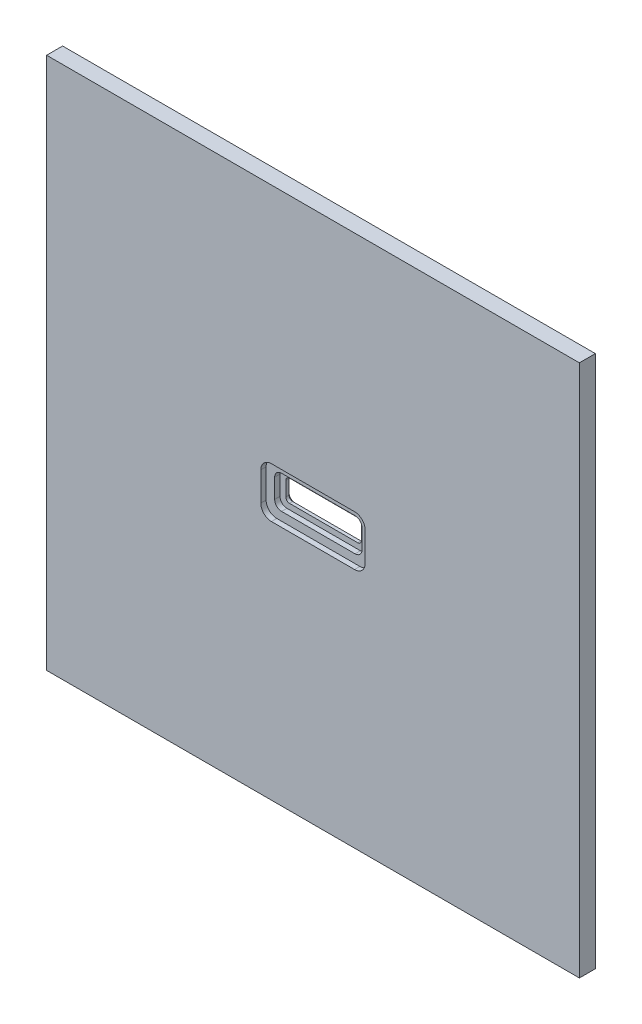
from build123d import *

# Parameters (mm, degrees)
SKETCH1_W           = 50
SKETCH1_H           = 50
BOSS_EXTRUDE1_DEPTH = 1.5
CUT_EXTRUDE1_DEPTH  = 36.387144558
CUT_EXTRUDE2_DEPTH  = 1
CUT_EXTRUDE3_DEPTH  = 0.5
CHAMFER1_SIZE       = 0.2


with BuildPart() as part:
    # Sketch1 → Boss-Extrude1 (new body)
    with BuildSketch(Plane.XY):
        Rectangle(SKETCH1_W, SKETCH1_H)
    extrude(amount=BOSS_EXTRUDE1_DEPTH)

    # Sketch3 → Cut-Extrude1 (cut, through all)
    with BuildSketch(Plane.XY.offset(1.5)):
        with BuildLine():
            ThreePointArc((-3.55, 0.675), (-3.447487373, 0.922487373), (-3.2, 1.025))
            Line((-3.2, 1.025), (3.2, 1.025))
            ThreePointArc((3.2, 1.025), (3.447487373, 0.922487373), (3.55, 0.675))
            Line((3.55, 0.675), (3.55, -0.675))
            ThreePointArc((3.55, -0.675), (3.447487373, -0.922487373), (3.2, -1.025))
            Line((3.2, -1.025), (-3.2, -1.025))
            ThreePointArc((-3.2, -1.025), (-3.447487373, -0.922487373), (-3.55, -0.675))
            Line((-3.55, -0.675), (-3.55, 0.675))
        make_face()
    extrude(amount=-CUT_EXTRUDE1_DEPTH, mode=Mode.SUBTRACT)

    # Sketch3_3 → Cut-Extrude2 (cut)
    with BuildSketch(Plane.XY.offset(1.5)):
        with BuildLine():
            ThreePointArc((-4.1, 0.9), (-3.909619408, 1.359619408), (-3.45, 1.55))
            Line((-3.45, 1.55), (3.45, 1.55))
            ThreePointArc((3.45, 1.55), (3.909619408, 1.359619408), (4.1, 0.9))
            Line((4.1, 0.9), (4.1, -0.9))
            ThreePointArc((4.1, -0.9), (3.909619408, -1.359619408), (3.45, -1.55))
            Line((3.45, -1.55), (-3.45, -1.55))
            ThreePointArc((-3.45, -1.55), (-3.909619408, -1.359619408), (-4.1, -0.9))
            Line((-4.1, -0.9), (-4.1, 0.9))
        make_face()
        with BuildLine():
            Line((-3.55, -0.675), (-3.55, 0.675))
            ThreePointArc((-3.55, 0.675), (-3.447487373, 0.922487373), (-3.2, 1.025))
            Line((-3.2, 1.025), (3.2, 1.025))
            ThreePointArc((3.2, 1.025), (3.447487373, 0.922487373), (3.55, 0.675))
            Line((3.55, 0.675), (3.55, -0.675))
            ThreePointArc((3.55, -0.675), (3.447487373, -0.922487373), (3.2, -1.025))
            Line((3.2, -1.025), (-3.2, -1.025))
            ThreePointArc((-3.2, -1.025), (-3.447487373, -0.922487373), (-3.55, -0.675))
        make_face(mode=Mode.SUBTRACT)
    extrude(amount=-CUT_EXTRUDE2_DEPTH, mode=Mode.SUBTRACT)

    # Sketch3_4 → Cut-Extrude3 (cut)
    with BuildSketch(Plane.XY.offset(1.5)):
        with BuildLine():
            ThreePointArc((-4.9, 1.35), (-4.607106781, 2.057106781), (-3.9, 2.35))
            Line((-3.9, 2.35), (3.9, 2.35))
            ThreePointArc((3.9, 2.35), (4.607106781, 2.057106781), (4.9, 1.35))
            Line((4.9, 1.35), (4.9, -1.35))
            ThreePointArc((4.9, -1.35), (4.607106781, -2.057106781), (3.9, -2.35))
            Line((3.9, -2.35), (-3.9, -2.35))
            ThreePointArc((-3.9, -2.35), (-4.607106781, -2.057106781), (-4.9, -1.35))
            Line((-4.9, -1.35), (-4.9, 1.35))
        make_face()
        with BuildLine():
            Line((-4.1, -0.9), (-4.1, 0.9))
            ThreePointArc((-4.1, 0.9), (-3.909619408, 1.359619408), (-3.45, 1.55))
            Line((-3.45, 1.55), (3.45, 1.55))
            ThreePointArc((3.45, 1.55), (3.909619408, 1.359619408), (4.1, 0.9))
            Line((4.1, 0.9), (4.1, -0.9))
            ThreePointArc((4.1, -0.9), (3.909619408, -1.359619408), (3.45, -1.55))
            Line((3.45, -1.55), (-3.45, -1.55))
            ThreePointArc((-3.45, -1.55), (-3.909619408, -1.359619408), (-4.1, -0.9))
        make_face(mode=Mode.SUBTRACT)
    extrude(amount=-CUT_EXTRUDE3_DEPTH, mode=Mode.SUBTRACT)

    # Chamfer1
    chamfer1_edges = [part.edges().sort_by_distance(p)[0] for p in [
        (3.55, 0, 0),
        (3.447487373, -0.922487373, 0),
        (0, -1.025, 0),
        (-3.447487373, 0.922487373, 0),
        (0, 1.025, 0),
        (3.447487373, 0.922487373, 0),
        (-3.447487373, -0.922487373, 0),
        (-3.55, 0, 0),
    ]]
    chamfer(chamfer1_edges, length=CHAMFER1_SIZE)


solid = part.part
